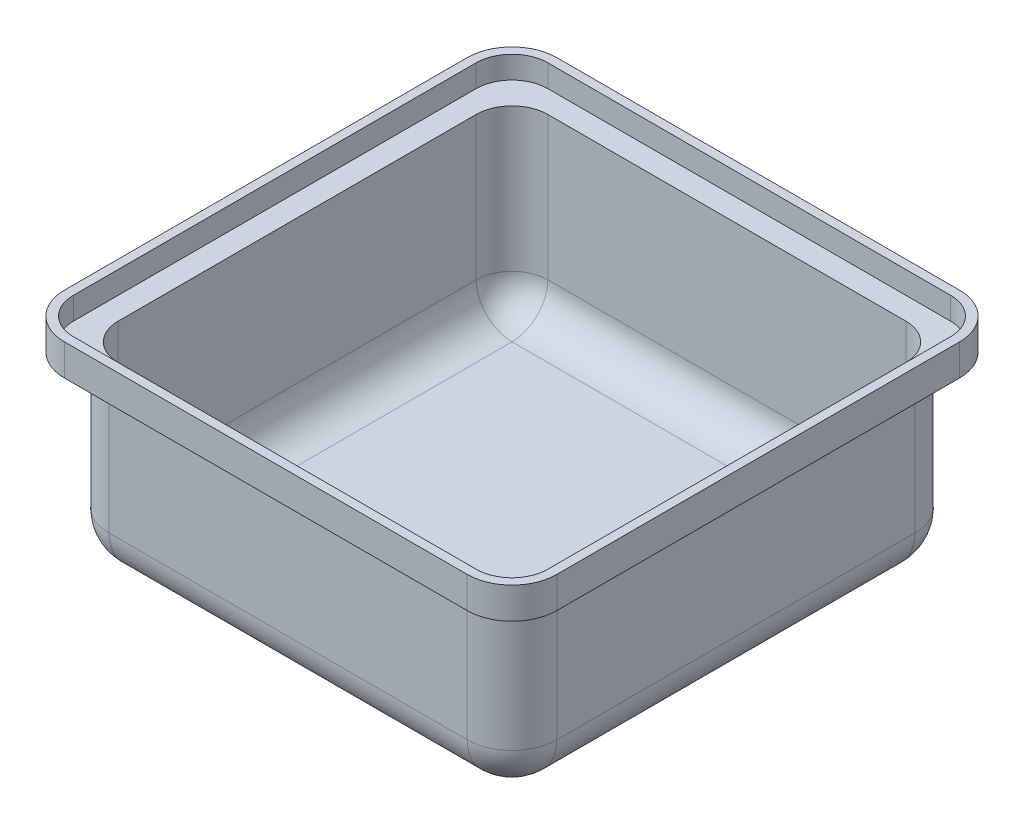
ISO-10303-21;
HEADER;
FILE_DESCRIPTION(('STEP AP214'),'2;1');
FILE_NAME('part.step','',(''),(''),'','','');
FILE_SCHEMA(('AUTOMOTIVE_DESIGN { 1 0 10303 214 1 1 1 1 }'));
ENDSEC;
DATA;
#1=APPLICATION_CONTEXT('core data for automotive mechanical design processes');
#2=APPLICATION_PROTOCOL_DEFINITION('international standard','automotive_design',2000,#1);
#3=PRODUCT_CONTEXT('',#1,'mechanical');
#4=PRODUCT('Part','Part','',(#3));
#5=PRODUCT_RELATED_PRODUCT_CATEGORY('part','',(#4));
#6=PRODUCT_DEFINITION_FORMATION('','',#4);
#7=PRODUCT_DEFINITION_CONTEXT('part definition',#1,'design');
#8=PRODUCT_DEFINITION('design','',#6,#7);
#9=PRODUCT_DEFINITION_SHAPE('','',#8);
#10=(LENGTH_UNIT() NAMED_UNIT(*) SI_UNIT(.MILLI.,.METRE.));
#11=(NAMED_UNIT(*) PLANE_ANGLE_UNIT() SI_UNIT($,.RADIAN.));
#12=(NAMED_UNIT(*) SI_UNIT($,.STERADIAN.) SOLID_ANGLE_UNIT());
#13=UNCERTAINTY_MEASURE_WITH_UNIT(LENGTH_MEASURE(1.E-05),#10,'distance_accuracy_value','');
#14=(GEOMETRIC_REPRESENTATION_CONTEXT(3) GLOBAL_UNCERTAINTY_ASSIGNED_CONTEXT((#13)) GLOBAL_UNIT_ASSIGNED_CONTEXT((#10,
#11,#12)) REPRESENTATION_CONTEXT('',''));
#15=CARTESIAN_POINT('',(0.,0.,0.));
#16=DIRECTION('',(0.,0.,1.));
#17=DIRECTION('',(1.,0.,0.));
#18=AXIS2_PLACEMENT_3D('',#15,#16,#17);
#19=CARTESIAN_POINT('',(69.85,59.69,69.85));
#20=DIRECTION('',(0.,-1.,0.));
#21=DIRECTION('',(0.,0.,-1.));
#22=AXIS2_PLACEMENT_3D('',#19,#20,#21);
#23=PLANE('',#22);
#24=DIRECTION('',(0.,0.,1.));
#25=VECTOR('',#24,1.);
#26=CARTESIAN_POINT('',(-69.85,59.69,-69.85));
#27=LINE('',#26,#25);
#28=CARTESIAN_POINT('',(-69.85,59.69,-57.15));
#29=VERTEX_POINT('',#28);
#30=CARTESIAN_POINT('',(-69.85,59.69,57.15));
#31=VERTEX_POINT('',#30);
#32=EDGE_CURVE('E439',#29,#31,#27,.T.);
#33=ORIENTED_EDGE('',*,*,#32,.T.);
#34=CARTESIAN_POINT('',(-57.15,59.69,57.15));
#35=DIRECTION('',(0.,-1.,0.));
#36=DIRECTION('',(0.,0.,-1.));
#37=AXIS2_PLACEMENT_3D('',#34,#35,#36);
#38=CIRCLE('',#37,12.7);
#39=CARTESIAN_POINT('',(-57.15,59.69,69.85));
#40=VERTEX_POINT('',#39);
#41=EDGE_CURVE('E515',#31,#40,#38,.F.);
#42=ORIENTED_EDGE('',*,*,#41,.T.);
#43=DIRECTION('',(1.,0.,0.));
#44=VECTOR('',#43,1.);
#45=CARTESIAN_POINT('',(69.85,59.69,69.85));
#46=LINE('',#45,#44);
#47=CARTESIAN_POINT('',(57.15,59.69,69.85));
#48=VERTEX_POINT('',#47);
#49=EDGE_CURVE('E442',#40,#48,#46,.T.);
#50=ORIENTED_EDGE('',*,*,#49,.T.);
#51=CARTESIAN_POINT('',(57.15,59.69,57.15));
#52=DIRECTION('',(0.,-1.,0.));
#53=DIRECTION('',(0.,0.,-1.));
#54=AXIS2_PLACEMENT_3D('',#51,#52,#53);
#55=CIRCLE('',#54,12.7);
#56=CARTESIAN_POINT('',(69.85,59.69,57.15));
#57=VERTEX_POINT('',#56);
#58=EDGE_CURVE('E509',#48,#57,#55,.F.);
#59=ORIENTED_EDGE('',*,*,#58,.T.);
#60=DIRECTION('',(0.,0.,-1.));
#61=VECTOR('',#60,1.);
#62=CARTESIAN_POINT('',(69.85,59.69,-69.85));
#63=LINE('',#62,#61);
#64=CARTESIAN_POINT('',(69.85,59.69,-57.15));
#65=VERTEX_POINT('',#64);
#66=EDGE_CURVE('E434',#57,#65,#63,.T.);
#67=ORIENTED_EDGE('',*,*,#66,.T.);
#68=CARTESIAN_POINT('',(57.15,59.69,-57.15));
#69=DIRECTION('',(0.,-1.,0.));
#70=DIRECTION('',(0.,0.,-1.));
#71=AXIS2_PLACEMENT_3D('',#68,#69,#70);
#72=CIRCLE('',#71,12.7);
#73=CARTESIAN_POINT('',(57.15,59.69,-69.85));
#74=VERTEX_POINT('',#73);
#75=EDGE_CURVE('E511',#65,#74,#72,.F.);
#76=ORIENTED_EDGE('',*,*,#75,.T.);
#77=DIRECTION('',(-1.,0.,0.));
#78=VECTOR('',#77,1.);
#79=CARTESIAN_POINT('',(69.85,59.69,-69.85));
#80=LINE('',#79,#78);
#81=CARTESIAN_POINT('',(-57.15,59.69,-69.85));
#82=VERTEX_POINT('',#81);
#83=EDGE_CURVE('E437',#74,#82,#80,.T.);
#84=ORIENTED_EDGE('',*,*,#83,.T.);
#85=CARTESIAN_POINT('',(-57.15,59.69,-57.15));
#86=DIRECTION('',(0.,-1.,0.));
#87=DIRECTION('',(0.,0.,-1.));
#88=AXIS2_PLACEMENT_3D('',#85,#86,#87);
#89=CIRCLE('',#88,12.7);
#90=EDGE_CURVE('E513',#82,#29,#89,.F.);
#91=ORIENTED_EDGE('',*,*,#90,.T.);
#92=EDGE_LOOP('',(#33,#42,#50,#59,#67,#76,#84,#91));
#93=FACE_BOUND('',#92,.T.);
#94=DIRECTION('',(0.,0.,1.));
#95=VECTOR('',#94,1.);
#96=CARTESIAN_POINT('',(-67.31,59.69,69.85));
#97=LINE('',#96,#95);
#98=CARTESIAN_POINT('',(-67.31,59.69,-57.15));
#99=VERTEX_POINT('',#98);
#100=CARTESIAN_POINT('',(-67.31,59.69,57.15));
#101=VERTEX_POINT('',#100);
#102=EDGE_CURVE('E379',#99,#101,#97,.T.);
#103=ORIENTED_EDGE('',*,*,#102,.F.);
#104=CARTESIAN_POINT('',(-57.15,59.69,-57.15));
#105=DIRECTION('',(0.,-1.,0.));
#106=DIRECTION('',(0.,0.,-1.));
#107=AXIS2_PLACEMENT_3D('',#104,#105,#106);
#108=CIRCLE('',#107,10.16);
#109=CARTESIAN_POINT('',(-57.15,59.69,-67.31));
#110=VERTEX_POINT('',#109);
#111=EDGE_CURVE('E377',#110,#99,#108,.F.);
#112=ORIENTED_EDGE('',*,*,#111,.F.);
#113=DIRECTION('',(-1.,0.,0.));
#114=VECTOR('',#113,1.);
#115=CARTESIAN_POINT('',(69.85,59.69,-67.31));
#116=LINE('',#115,#114);
#117=CARTESIAN_POINT('',(57.15,59.69,-67.31));
#118=VERTEX_POINT('',#117);
#119=EDGE_CURVE('E41',#118,#110,#116,.T.);
#120=ORIENTED_EDGE('',*,*,#119,.F.);
#121=CARTESIAN_POINT('',(57.15,59.69,-57.15));
#122=DIRECTION('',(0.,-1.,0.));
#123=DIRECTION('',(0.,0.,-1.));
#124=AXIS2_PLACEMENT_3D('',#121,#122,#123);
#125=CIRCLE('',#124,10.16);
#126=CARTESIAN_POINT('',(67.31,59.69,-57.15));
#127=VERTEX_POINT('',#126);
#128=EDGE_CURVE('E375',#127,#118,#125,.F.);
#129=ORIENTED_EDGE('',*,*,#128,.F.);
#130=DIRECTION('',(0.,0.,-1.));
#131=VECTOR('',#130,1.);
#132=CARTESIAN_POINT('',(67.31,59.69,69.85));
#133=LINE('',#132,#131);
#134=CARTESIAN_POINT('',(67.31,59.69,57.15));
#135=VERTEX_POINT('',#134);
#136=EDGE_CURVE('E371',#135,#127,#133,.T.);
#137=ORIENTED_EDGE('',*,*,#136,.F.);
#138=CARTESIAN_POINT('',(57.15,59.69,57.15));
#139=DIRECTION('',(0.,-1.,0.));
#140=DIRECTION('',(0.,0.,-1.));
#141=AXIS2_PLACEMENT_3D('',#138,#139,#140);
#142=CIRCLE('',#141,10.16);
#143=CARTESIAN_POINT('',(57.15,59.69,67.31));
#144=VERTEX_POINT('',#143);
#145=EDGE_CURVE('E365',#144,#135,#142,.F.);
#146=ORIENTED_EDGE('',*,*,#145,.F.);
#147=DIRECTION('',(1.,0.,0.));
#148=VECTOR('',#147,1.);
#149=CARTESIAN_POINT('',(69.85,59.69,67.31));
#150=LINE('',#149,#148);
#151=CARTESIAN_POINT('',(-57.15,59.69,67.31));
#152=VERTEX_POINT('',#151);
#153=EDGE_CURVE('E383',#152,#144,#150,.T.);
#154=ORIENTED_EDGE('',*,*,#153,.F.);
#155=CARTESIAN_POINT('',(-57.15,59.69,57.15));
#156=DIRECTION('',(0.,-1.,0.));
#157=DIRECTION('',(0.,0.,-1.));
#158=AXIS2_PLACEMENT_3D('',#155,#156,#157);
#159=CIRCLE('',#158,10.16);
#160=EDGE_CURVE('E357',#101,#152,#159,.F.);
#161=ORIENTED_EDGE('',*,*,#160,.F.);
#162=EDGE_LOOP('',(#103,#112,#120,#129,#137,#146,#154,#161));
#163=FACE_BOUND('',#162,.T.);
#164=ADVANCED_FACE('F26',(#93,#163),#23,.F.);
#165=CARTESIAN_POINT('',(-63.5,50.8,-63.5));
#166=DIRECTION('',(1.,0.,0.));
#167=DIRECTION('',(0.,0.,-1.));
#168=AXIS2_PLACEMENT_3D('',#165,#166,#167);
#169=PLANE('',#168);
#170=DIRECTION('',(0.,0.,1.));
#171=VECTOR('',#170,1.);
#172=CARTESIAN_POINT('',(-63.5,12.7,-63.5));
#173=LINE('',#172,#171);
#174=CARTESIAN_POINT('',(-63.5,12.7,-50.8));
#175=VERTEX_POINT('',#174);
#176=CARTESIAN_POINT('',(-63.5,12.7,50.8));
#177=VERTEX_POINT('',#176);
#178=EDGE_CURVE('E487',#175,#177,#173,.T.);
#179=ORIENTED_EDGE('',*,*,#178,.T.);
#180=DIRECTION('',(0.,-1.,0.));
#181=VECTOR('',#180,1.);
#182=CARTESIAN_POINT('',(-63.5,50.8,50.8));
#183=LINE('',#182,#181);
#184=CARTESIAN_POINT('',(-63.5,50.8,50.8));
#185=VERTEX_POINT('',#184);
#186=EDGE_CURVE('E489',#177,#185,#183,.F.);
#187=ORIENTED_EDGE('',*,*,#186,.T.);
#188=DIRECTION('',(0.,0.,1.));
#189=VECTOR('',#188,1.);
#190=CARTESIAN_POINT('',(-63.5,50.8,-63.5));
#191=LINE('',#190,#189);
#192=CARTESIAN_POINT('',(-63.5,50.8,-50.8));
#193=VERTEX_POINT('',#192);
#194=EDGE_CURVE('E445',#193,#185,#191,.T.);
#195=ORIENTED_EDGE('',*,*,#194,.F.);
#196=DIRECTION('',(0.,-1.,0.));
#197=VECTOR('',#196,1.);
#198=CARTESIAN_POINT('',(-63.5,50.8,-50.8));
#199=LINE('',#198,#197);
#200=EDGE_CURVE('E485',#193,#175,#199,.T.);
#201=ORIENTED_EDGE('',*,*,#200,.T.);
#202=EDGE_LOOP('',(#179,#187,#195,#201));
#203=FACE_BOUND('',#202,.T.);
#204=ADVANCED_FACE('F28',(#203),#169,.F.);
#205=CARTESIAN_POINT('',(-63.5,50.8,63.5));
#206=DIRECTION('',(0.,0.,-1.));
#207=DIRECTION('',(-1.,0.,0.));
#208=AXIS2_PLACEMENT_3D('',#205,#206,#207);
#209=PLANE('',#208);
#210=DIRECTION('',(1.,0.,0.));
#211=VECTOR('',#210,1.);
#212=CARTESIAN_POINT('',(-63.5,50.8,63.5));
#213=LINE('',#212,#211);
#214=CARTESIAN_POINT('',(-50.8,50.8,63.5));
#215=VERTEX_POINT('',#214);
#216=CARTESIAN_POINT('',(50.8,50.8,63.5));
#217=VERTEX_POINT('',#216);
#218=EDGE_CURVE('E448',#215,#217,#213,.T.);
#219=ORIENTED_EDGE('',*,*,#218,.F.);
#220=DIRECTION('',(0.,-1.,0.));
#221=VECTOR('',#220,1.);
#222=CARTESIAN_POINT('',(-50.8,50.8,63.5));
#223=LINE('',#222,#221);
#224=CARTESIAN_POINT('',(-50.8,12.7,63.5));
#225=VERTEX_POINT('',#224);
#226=EDGE_CURVE('E462',#215,#225,#223,.T.);
#227=ORIENTED_EDGE('',*,*,#226,.T.);
#228=DIRECTION('',(1.,0.,0.));
#229=VECTOR('',#228,1.);
#230=CARTESIAN_POINT('',(-63.5,12.7,63.5));
#231=LINE('',#230,#229);
#232=CARTESIAN_POINT('',(50.8,12.7,63.5));
#233=VERTEX_POINT('',#232);
#234=EDGE_CURVE('E459',#225,#233,#231,.T.);
#235=ORIENTED_EDGE('',*,*,#234,.T.);
#236=DIRECTION('',(0.,-1.,0.));
#237=VECTOR('',#236,1.);
#238=CARTESIAN_POINT('',(50.8,50.8,63.5));
#239=LINE('',#238,#237);
#240=EDGE_CURVE('E457',#233,#217,#239,.F.);
#241=ORIENTED_EDGE('',*,*,#240,.T.);
#242=EDGE_LOOP('',(#219,#227,#235,#241));
#243=FACE_BOUND('',#242,.T.);
#244=ADVANCED_FACE('F581',(#243),#209,.F.);
#245=CARTESIAN_POINT('',(63.5,50.8,-63.5));
#246=DIRECTION('',(-1.,0.,0.));
#247=DIRECTION('',(0.,0.,1.));
#248=AXIS2_PLACEMENT_3D('',#245,#246,#247);
#249=PLANE('',#248);
#250=DIRECTION('',(0.,0.,-1.));
#251=VECTOR('',#250,1.);
#252=CARTESIAN_POINT('',(63.5,50.8,-63.5));
#253=LINE('',#252,#251);
#254=CARTESIAN_POINT('',(63.5,50.8,50.8));
#255=VERTEX_POINT('',#254);
#256=CARTESIAN_POINT('',(63.5,50.8,-50.8));
#257=VERTEX_POINT('',#256);
#258=EDGE_CURVE('E451',#255,#257,#253,.T.);
#259=ORIENTED_EDGE('',*,*,#258,.F.);
#260=DIRECTION('',(0.,-1.,0.));
#261=VECTOR('',#260,1.);
#262=CARTESIAN_POINT('',(63.5,50.8,50.8));
#263=LINE('',#262,#261);
#264=CARTESIAN_POINT('',(63.5,12.7,50.8));
#265=VERTEX_POINT('',#264);
#266=EDGE_CURVE('E477',#255,#265,#263,.T.);
#267=ORIENTED_EDGE('',*,*,#266,.T.);
#268=DIRECTION('',(0.,0.,-1.));
#269=VECTOR('',#268,1.);
#270=CARTESIAN_POINT('',(63.5,12.7,-63.5));
#271=LINE('',#270,#269);
#272=CARTESIAN_POINT('',(63.5,12.7,-50.8));
#273=VERTEX_POINT('',#272);
#274=EDGE_CURVE('E475',#265,#273,#271,.T.);
#275=ORIENTED_EDGE('',*,*,#274,.T.);
#276=DIRECTION('',(0.,-1.,0.));
#277=VECTOR('',#276,1.);
#278=CARTESIAN_POINT('',(63.5,50.8,-50.8));
#279=LINE('',#278,#277);
#280=EDGE_CURVE('E473',#273,#257,#279,.F.);
#281=ORIENTED_EDGE('',*,*,#280,.T.);
#282=EDGE_LOOP('',(#259,#267,#275,#281));
#283=FACE_BOUND('',#282,.T.);
#284=ADVANCED_FACE('F590',(#283),#249,.F.);
#285=CARTESIAN_POINT('',(-63.5,50.8,-63.5));
#286=DIRECTION('',(0.,0.,1.));
#287=DIRECTION('',(1.,0.,0.));
#288=AXIS2_PLACEMENT_3D('',#285,#286,#287);
#289=PLANE('',#288);
#290=DIRECTION('',(-1.,0.,0.));
#291=VECTOR('',#290,1.);
#292=CARTESIAN_POINT('',(-63.5,50.8,-63.5));
#293=LINE('',#292,#291);
#294=CARTESIAN_POINT('',(50.8,50.8,-63.5));
#295=VERTEX_POINT('',#294);
#296=CARTESIAN_POINT('',(-50.8,50.8,-63.5));
#297=VERTEX_POINT('',#296);
#298=EDGE_CURVE('E454',#295,#297,#293,.T.);
#299=ORIENTED_EDGE('',*,*,#298,.F.);
#300=DIRECTION('',(0.,-1.,0.));
#301=VECTOR('',#300,1.);
#302=CARTESIAN_POINT('',(50.8,50.8,-63.5));
#303=LINE('',#302,#301);
#304=CARTESIAN_POINT('',(50.8,12.7,-63.5));
#305=VERTEX_POINT('',#304);
#306=EDGE_CURVE('E483',#295,#305,#303,.T.);
#307=ORIENTED_EDGE('',*,*,#306,.T.);
#308=DIRECTION('',(-1.,0.,0.));
#309=VECTOR('',#308,1.);
#310=CARTESIAN_POINT('',(-63.5,12.7,-63.5));
#311=LINE('',#310,#309);
#312=CARTESIAN_POINT('',(-50.8,12.7,-63.5));
#313=VERTEX_POINT('',#312);
#314=EDGE_CURVE('E481',#305,#313,#311,.T.);
#315=ORIENTED_EDGE('',*,*,#314,.T.);
#316=DIRECTION('',(0.,-1.,0.));
#317=VECTOR('',#316,1.);
#318=CARTESIAN_POINT('',(-50.8,50.8,-63.5));
#319=LINE('',#318,#317);
#320=EDGE_CURVE('E479',#313,#297,#319,.F.);
#321=ORIENTED_EDGE('',*,*,#320,.T.);
#322=EDGE_LOOP('',(#299,#307,#315,#321));
#323=FACE_BOUND('',#322,.T.);
#324=ADVANCED_FACE('F539',(#323),#289,.F.);
#325=CARTESIAN_POINT('',(-63.5,0.,63.5));
#326=DIRECTION('',(0.,1.,0.));
#327=DIRECTION('',(0.,0.,1.));
#328=AXIS2_PLACEMENT_3D('',#325,#326,#327);
#329=PLANE('',#328);
#330=DIRECTION('',(0.,0.,-1.));
#331=VECTOR('',#330,1.);
#332=CARTESIAN_POINT('',(50.8,0.,63.5));
#333=LINE('',#332,#331);
#334=CARTESIAN_POINT('',(50.8,0.,-50.8));
#335=VERTEX_POINT('',#334);
#336=CARTESIAN_POINT('',(50.8,0.,50.8));
#337=VERTEX_POINT('',#336);
#338=EDGE_CURVE('E468',#335,#337,#333,.F.);
#339=ORIENTED_EDGE('',*,*,#338,.T.);
#340=DIRECTION('',(1.,0.,0.));
#341=VECTOR('',#340,1.);
#342=CARTESIAN_POINT('',(-63.5,0.,50.8));
#343=LINE('',#342,#341);
#344=CARTESIAN_POINT('',(-50.8,0.,50.8));
#345=VERTEX_POINT('',#344);
#346=EDGE_CURVE('E470',#337,#345,#343,.F.);
#347=ORIENTED_EDGE('',*,*,#346,.T.);
#348=DIRECTION('',(0.,0.,1.));
#349=VECTOR('',#348,1.);
#350=CARTESIAN_POINT('',(-50.8,0.,63.5));
#351=LINE('',#350,#349);
#352=CARTESIAN_POINT('',(-50.8,0.,-50.8));
#353=VERTEX_POINT('',#352);
#354=EDGE_CURVE('E464',#345,#353,#351,.F.);
#355=ORIENTED_EDGE('',*,*,#354,.T.);
#356=DIRECTION('',(-1.,0.,0.));
#357=VECTOR('',#356,1.);
#358=CARTESIAN_POINT('',(-63.5,0.,-50.8));
#359=LINE('',#358,#357);
#360=EDGE_CURVE('E466',#353,#335,#359,.F.);
#361=ORIENTED_EDGE('',*,*,#360,.T.);
#362=EDGE_LOOP('',(#339,#347,#355,#361));
#363=FACE_BOUND('',#362,.T.);
#364=ADVANCED_FACE('F595',(#363),#329,.F.);
#365=CARTESIAN_POINT('',(69.85,50.8,69.85));
#366=DIRECTION('',(0.,-1.,0.));
#367=DIRECTION('',(0.,0.,-1.));
#368=AXIS2_PLACEMENT_3D('',#365,#366,#367);
#369=PLANE('',#368);
#370=DIRECTION('',(1.,0.,0.));
#371=VECTOR('',#370,1.);
#372=CARTESIAN_POINT('',(69.85,50.8,69.85));
#373=LINE('',#372,#371);
#374=CARTESIAN_POINT('',(-57.15,50.8,69.85));
#375=VERTEX_POINT('',#374);
#376=CARTESIAN_POINT('',(57.15,50.8,69.85));
#377=VERTEX_POINT('',#376);
#378=EDGE_CURVE('E431',#375,#377,#373,.T.);
#379=ORIENTED_EDGE('',*,*,#378,.F.);
#380=CARTESIAN_POINT('',(-57.15,50.8,57.15));
#381=DIRECTION('',(0.,-1.,0.));
#382=DIRECTION('',(0.,0.,-1.));
#383=AXIS2_PLACEMENT_3D('',#380,#381,#382);
#384=CIRCLE('',#383,12.7);
#385=CARTESIAN_POINT('',(-69.85,50.8,57.15));
#386=VERTEX_POINT('',#385);
#387=EDGE_CURVE('E502',#375,#386,#384,.T.);
#388=ORIENTED_EDGE('',*,*,#387,.T.);
#389=DIRECTION('',(0.,0.,1.));
#390=VECTOR('',#389,1.);
#391=CARTESIAN_POINT('',(-69.85,50.8,-69.85));
#392=LINE('',#391,#390);
#393=CARTESIAN_POINT('',(-69.85,50.8,-57.15));
#394=VERTEX_POINT('',#393);
#395=EDGE_CURVE('E428',#394,#386,#392,.T.);
#396=ORIENTED_EDGE('',*,*,#395,.F.);
#397=CARTESIAN_POINT('',(-57.15,50.8,-57.15));
#398=DIRECTION('',(0.,-1.,0.));
#399=DIRECTION('',(0.,0.,-1.));
#400=AXIS2_PLACEMENT_3D('',#397,#398,#399);
#401=CIRCLE('',#400,12.7);
#402=CARTESIAN_POINT('',(-57.15,50.8,-69.85));
#403=VERTEX_POINT('',#402);
#404=EDGE_CURVE('E500',#394,#403,#401,.T.);
#405=ORIENTED_EDGE('',*,*,#404,.T.);
#406=DIRECTION('',(-1.,0.,0.));
#407=VECTOR('',#406,1.);
#408=CARTESIAN_POINT('',(69.85,50.8,-69.85));
#409=LINE('',#408,#407);
#410=CARTESIAN_POINT('',(57.15,50.8,-69.85));
#411=VERTEX_POINT('',#410);
#412=EDGE_CURVE('E426',#411,#403,#409,.T.);
#413=ORIENTED_EDGE('',*,*,#412,.F.);
#414=CARTESIAN_POINT('',(57.15,50.8,-57.15));
#415=DIRECTION('',(0.,-1.,0.));
#416=DIRECTION('',(0.,0.,-1.));
#417=AXIS2_PLACEMENT_3D('',#414,#415,#416);
#418=CIRCLE('',#417,12.7);
#419=CARTESIAN_POINT('',(69.85,50.8,-57.15));
#420=VERTEX_POINT('',#419);
#421=EDGE_CURVE('E498',#411,#420,#418,.T.);
#422=ORIENTED_EDGE('',*,*,#421,.T.);
#423=DIRECTION('',(0.,0.,-1.));
#424=VECTOR('',#423,1.);
#425=CARTESIAN_POINT('',(69.85,50.8,-69.85));
#426=LINE('',#425,#424);
#427=CARTESIAN_POINT('',(69.85,50.8,57.15));
#428=VERTEX_POINT('',#427);
#429=EDGE_CURVE('E423',#428,#420,#426,.T.);
#430=ORIENTED_EDGE('',*,*,#429,.F.);
#431=CARTESIAN_POINT('',(57.15,50.8,57.15));
#432=DIRECTION('',(0.,-1.,0.));
#433=DIRECTION('',(0.,0.,-1.));
#434=AXIS2_PLACEMENT_3D('',#431,#432,#433);
#435=CIRCLE('',#434,12.7);
#436=EDGE_CURVE('E496',#428,#377,#435,.T.);
#437=ORIENTED_EDGE('',*,*,#436,.T.);
#438=EDGE_LOOP('',(#379,#388,#396,#405,#413,#422,#430,#437));
#439=FACE_BOUND('',#438,.T.);
#440=ORIENTED_EDGE('',*,*,#298,.T.);
#441=CARTESIAN_POINT('',(-50.8,50.8,-50.8));
#442=DIRECTION('',(0.,-1.,0.));
#443=DIRECTION('',(0.,0.,-1.));
#444=AXIS2_PLACEMENT_3D('',#441,#442,#443);
#445=CIRCLE('',#444,12.7);
#446=EDGE_CURVE('E11',#297,#193,#445,.F.);
#447=ORIENTED_EDGE('',*,*,#446,.T.);
#448=ORIENTED_EDGE('',*,*,#194,.T.);
#449=CARTESIAN_POINT('',(-50.8,50.8,50.8));
#450=DIRECTION('',(0.,-1.,0.));
#451=DIRECTION('',(0.,0.,-1.));
#452=AXIS2_PLACEMENT_3D('',#449,#450,#451);
#453=CIRCLE('',#452,12.7);
#454=EDGE_CURVE('E526',#185,#215,#453,.F.);
#455=ORIENTED_EDGE('',*,*,#454,.T.);
#456=ORIENTED_EDGE('',*,*,#218,.T.);
#457=CARTESIAN_POINT('',(50.8,50.8,50.8));
#458=DIRECTION('',(0.,-1.,0.));
#459=DIRECTION('',(0.,0.,-1.));
#460=AXIS2_PLACEMENT_3D('',#457,#458,#459);
#461=CIRCLE('',#460,12.7);
#462=EDGE_CURVE('E528',#217,#255,#461,.F.);
#463=ORIENTED_EDGE('',*,*,#462,.T.);
#464=ORIENTED_EDGE('',*,*,#258,.T.);
#465=CARTESIAN_POINT('',(50.8,50.8,-50.8));
#466=DIRECTION('',(0.,-1.,0.));
#467=DIRECTION('',(0.,0.,-1.));
#468=AXIS2_PLACEMENT_3D('',#465,#466,#467);
#469=CIRCLE('',#468,12.7);
#470=EDGE_CURVE('E34',#257,#295,#469,.F.);
#471=ORIENTED_EDGE('',*,*,#470,.T.);
#472=EDGE_LOOP('',(#440,#447,#448,#455,#456,#463,#464,#471));
#473=FACE_BOUND('',#472,.T.);
#474=ADVANCED_FACE('F532',(#439,#473),#369,.T.);
#475=CARTESIAN_POINT('',(69.85,59.69,-69.85));
#476=DIRECTION('',(-1.,0.,0.));
#477=DIRECTION('',(0.,0.,1.));
#478=AXIS2_PLACEMENT_3D('',#475,#476,#477);
#479=PLANE('',#478);
#480=ORIENTED_EDGE('',*,*,#429,.T.);
#481=DIRECTION('',(0.,-1.,0.));
#482=VECTOR('',#481,1.);
#483=CARTESIAN_POINT('',(69.85,59.69,-57.15));
#484=LINE('',#483,#482);
#485=EDGE_CURVE('E524',#420,#65,#484,.F.);
#486=ORIENTED_EDGE('',*,*,#485,.T.);
#487=ORIENTED_EDGE('',*,*,#66,.F.);
#488=DIRECTION('',(0.,-1.,0.));
#489=VECTOR('',#488,1.);
#490=CARTESIAN_POINT('',(69.85,59.69,57.15));
#491=LINE('',#490,#489);
#492=EDGE_CURVE('E521',#57,#428,#491,.T.);
#493=ORIENTED_EDGE('',*,*,#492,.T.);
#494=EDGE_LOOP('',(#480,#486,#487,#493));
#495=FACE_BOUND('',#494,.T.);
#496=ADVANCED_FACE('F630',(#495),#479,.F.);
#497=CARTESIAN_POINT('',(69.85,59.69,-69.85));
#498=DIRECTION('',(0.,0.,1.));
#499=DIRECTION('',(1.,0.,0.));
#500=AXIS2_PLACEMENT_3D('',#497,#498,#499);
#501=PLANE('',#500);
#502=ORIENTED_EDGE('',*,*,#412,.T.);
#503=DIRECTION('',(0.,-1.,0.));
#504=VECTOR('',#503,1.);
#505=CARTESIAN_POINT('',(-57.15,59.69,-69.85));
#506=LINE('',#505,#504);
#507=EDGE_CURVE('E49',#403,#82,#506,.F.);
#508=ORIENTED_EDGE('',*,*,#507,.T.);
#509=ORIENTED_EDGE('',*,*,#83,.F.);
#510=DIRECTION('',(0.,-1.,0.));
#511=VECTOR('',#510,1.);
#512=CARTESIAN_POINT('',(57.15,59.69,-69.85));
#513=LINE('',#512,#511);
#514=EDGE_CURVE('E517',#74,#411,#513,.T.);
#515=ORIENTED_EDGE('',*,*,#514,.T.);
#516=EDGE_LOOP('',(#502,#508,#509,#515));
#517=FACE_BOUND('',#516,.T.);
#518=ADVANCED_FACE('F626',(#517),#501,.F.);
#519=CARTESIAN_POINT('',(-69.85,59.69,-69.85));
#520=DIRECTION('',(1.,0.,0.));
#521=DIRECTION('',(0.,0.,-1.));
#522=AXIS2_PLACEMENT_3D('',#519,#520,#521);
#523=PLANE('',#522);
#524=ORIENTED_EDGE('',*,*,#395,.T.);
#525=DIRECTION('',(0.,-1.,0.));
#526=VECTOR('',#525,1.);
#527=CARTESIAN_POINT('',(-69.85,59.69,57.15));
#528=LINE('',#527,#526);
#529=EDGE_CURVE('E507',#386,#31,#528,.F.);
#530=ORIENTED_EDGE('',*,*,#529,.T.);
#531=ORIENTED_EDGE('',*,*,#32,.F.);
#532=DIRECTION('',(0.,-1.,0.));
#533=VECTOR('',#532,1.);
#534=CARTESIAN_POINT('',(-69.85,59.69,-57.15));
#535=LINE('',#534,#533);
#536=EDGE_CURVE('E504',#29,#394,#535,.T.);
#537=ORIENTED_EDGE('',*,*,#536,.T.);
#538=EDGE_LOOP('',(#524,#530,#531,#537));
#539=FACE_BOUND('',#538,.T.);
#540=ADVANCED_FACE('F622',(#539),#523,.F.);
#541=CARTESIAN_POINT('',(69.85,59.69,69.85));
#542=DIRECTION('',(0.,0.,-1.));
#543=DIRECTION('',(-1.,0.,0.));
#544=AXIS2_PLACEMENT_3D('',#541,#542,#543);
#545=PLANE('',#544);
#546=ORIENTED_EDGE('',*,*,#49,.F.);
#547=DIRECTION('',(0.,-1.,0.));
#548=VECTOR('',#547,1.);
#549=CARTESIAN_POINT('',(-57.15,59.69,69.85));
#550=LINE('',#549,#548);
#551=EDGE_CURVE('E493',#40,#375,#550,.T.);
#552=ORIENTED_EDGE('',*,*,#551,.T.);
#553=ORIENTED_EDGE('',*,*,#378,.T.);
#554=DIRECTION('',(0.,-1.,0.));
#555=VECTOR('',#554,1.);
#556=CARTESIAN_POINT('',(57.15,59.69,69.85));
#557=LINE('',#556,#555);
#558=EDGE_CURVE('E491',#377,#48,#557,.F.);
#559=ORIENTED_EDGE('',*,*,#558,.T.);
#560=EDGE_LOOP('',(#546,#552,#553,#559));
#561=FACE_BOUND('',#560,.T.);
#562=ADVANCED_FACE('F619',(#561),#545,.F.);
#563=CARTESIAN_POINT('',(-50.8,50.8,-50.8));
#564=DIRECTION('',(0.,-1.,0.));
#565=DIRECTION('',(0.,0.,-1.));
#566=AXIS2_PLACEMENT_3D('',#563,#564,#565);
#567=CYLINDRICAL_SURFACE('',#566,12.7);
#568=ORIENTED_EDGE('',*,*,#446,.F.);
#569=ORIENTED_EDGE('',*,*,#320,.F.);
#570=CARTESIAN_POINT('',(-50.8,12.7,-50.8));
#571=DIRECTION('',(0.,-1.,0.));
#572=DIRECTION('',(0.,0.,-1.));
#573=AXIS2_PLACEMENT_3D('',#570,#571,#572);
#574=CIRCLE('',#573,12.7);
#575=EDGE_CURVE('E417',#175,#313,#574,.T.);
#576=ORIENTED_EDGE('',*,*,#575,.F.);
#577=ORIENTED_EDGE('',*,*,#200,.F.);
#578=EDGE_LOOP('',(#568,#569,#576,#577));
#579=FACE_BOUND('',#578,.T.);
#580=ADVANCED_FACE('F555',(#579),#567,.T.);
#581=CARTESIAN_POINT('',(50.8,50.8,-50.8));
#582=DIRECTION('',(0.,-1.,0.));
#583=DIRECTION('',(0.,0.,-1.));
#584=AXIS2_PLACEMENT_3D('',#581,#582,#583);
#585=CYLINDRICAL_SURFACE('',#584,12.7);
#586=ORIENTED_EDGE('',*,*,#470,.F.);
#587=ORIENTED_EDGE('',*,*,#280,.F.);
#588=CARTESIAN_POINT('',(50.8,12.7,-50.8));
#589=DIRECTION('',(0.,-1.,0.));
#590=DIRECTION('',(0.,0.,-1.));
#591=AXIS2_PLACEMENT_3D('',#588,#589,#590);
#592=CIRCLE('',#591,12.7);
#593=EDGE_CURVE('E414',#305,#273,#592,.T.);
#594=ORIENTED_EDGE('',*,*,#593,.F.);
#595=ORIENTED_EDGE('',*,*,#306,.F.);
#596=EDGE_LOOP('',(#586,#587,#594,#595));
#597=FACE_BOUND('',#596,.T.);
#598=ADVANCED_FACE('F543',(#597),#585,.T.);
#599=CARTESIAN_POINT('',(-63.5,12.7,-50.8));
#600=DIRECTION('',(-1.,0.,0.));
#601=DIRECTION('',(0.,0.,1.));
#602=AXIS2_PLACEMENT_3D('',#599,#600,#601);
#603=CYLINDRICAL_SURFACE('',#602,12.7);
#604=CARTESIAN_POINT('',(-50.8,12.7,-50.8));
#605=DIRECTION('',(-1.,0.,0.));
#606=DIRECTION('',(0.,0.,1.));
#607=AXIS2_PLACEMENT_3D('',#604,#605,#606);
#608=CIRCLE('',#607,12.7);
#609=EDGE_CURVE('E420',#313,#353,#608,.T.);
#610=ORIENTED_EDGE('',*,*,#609,.F.);
#611=ORIENTED_EDGE('',*,*,#314,.F.);
#612=CARTESIAN_POINT('',(50.8,12.7,-50.8));
#613=DIRECTION('',(1.,0.,0.));
#614=DIRECTION('',(0.,0.,-1.));
#615=AXIS2_PLACEMENT_3D('',#612,#613,#614);
#616=CIRCLE('',#615,12.7);
#617=EDGE_CURVE('E411',#335,#305,#616,.T.);
#618=ORIENTED_EDGE('',*,*,#617,.F.);
#619=ORIENTED_EDGE('',*,*,#360,.F.);
#620=EDGE_LOOP('',(#610,#611,#618,#619));
#621=FACE_BOUND('',#620,.T.);
#622=ADVANCED_FACE('F552',(#621),#603,.T.);
#623=CARTESIAN_POINT('',(-50.8,12.7,-50.8));
#624=DIRECTION('',(0.,0.,1.));
#625=DIRECTION('',(1.,0.,0.));
#626=AXIS2_PLACEMENT_3D('',#623,#624,#625);
#627=SPHERICAL_SURFACE('',#626,12.7);
#628=ORIENTED_EDGE('',*,*,#575,.T.);
#629=ORIENTED_EDGE('',*,*,#609,.T.);
#630=CARTESIAN_POINT('',(-50.8,12.7,-50.8));
#631=DIRECTION('',(0.,0.,-1.));
#632=DIRECTION('',(-1.,0.,0.));
#633=AXIS2_PLACEMENT_3D('',#630,#631,#632);
#634=CIRCLE('',#633,12.7);
#635=EDGE_CURVE('E408',#175,#353,#634,.F.);
#636=ORIENTED_EDGE('',*,*,#635,.F.);
#637=EDGE_LOOP('',(#628,#629,#636));
#638=FACE_BOUND('',#637,.T.);
#639=ADVANCED_FACE('F695',(#638),#627,.T.);
#640=CARTESIAN_POINT('',(50.8,12.7,-50.8));
#641=DIRECTION('',(0.,0.,1.));
#642=DIRECTION('',(1.,0.,0.));
#643=AXIS2_PLACEMENT_3D('',#640,#641,#642);
#644=SPHERICAL_SURFACE('',#643,12.7);
#645=ORIENTED_EDGE('',*,*,#617,.T.);
#646=ORIENTED_EDGE('',*,*,#593,.T.);
#647=CARTESIAN_POINT('',(50.8,12.7,-50.8));
#648=DIRECTION('',(0.,0.,-1.));
#649=DIRECTION('',(-1.,0.,0.));
#650=AXIS2_PLACEMENT_3D('',#647,#648,#649);
#651=CIRCLE('',#650,12.7);
#652=EDGE_CURVE('E405',#335,#273,#651,.F.);
#653=ORIENTED_EDGE('',*,*,#652,.F.);
#654=EDGE_LOOP('',(#645,#646,#653));
#655=FACE_BOUND('',#654,.T.);
#656=ADVANCED_FACE('F547',(#655),#644,.T.);
#657=CARTESIAN_POINT('',(-50.8,12.7,-63.5));
#658=DIRECTION('',(0.,0.,1.));
#659=DIRECTION('',(1.,0.,0.));
#660=AXIS2_PLACEMENT_3D('',#657,#658,#659);
#661=CYLINDRICAL_SURFACE('',#660,12.7);
#662=ORIENTED_EDGE('',*,*,#635,.T.);
#663=ORIENTED_EDGE('',*,*,#354,.F.);
#664=CARTESIAN_POINT('',(-50.8,12.7,50.8));
#665=DIRECTION('',(0.,0.,1.));
#666=DIRECTION('',(1.,0.,0.));
#667=AXIS2_PLACEMENT_3D('',#664,#665,#666);
#668=CIRCLE('',#667,12.7);
#669=EDGE_CURVE('E402',#177,#345,#668,.T.);
#670=ORIENTED_EDGE('',*,*,#669,.F.);
#671=ORIENTED_EDGE('',*,*,#178,.F.);
#672=EDGE_LOOP('',(#662,#663,#670,#671));
#673=FACE_BOUND('',#672,.T.);
#674=ADVANCED_FACE('F571',(#673),#661,.T.);
#675=CARTESIAN_POINT('',(-50.8,50.8,50.8));
#676=DIRECTION('',(0.,-1.,0.));
#677=DIRECTION('',(0.,0.,-1.));
#678=AXIS2_PLACEMENT_3D('',#675,#676,#677);
#679=CYLINDRICAL_SURFACE('',#678,12.7);
#680=ORIENTED_EDGE('',*,*,#454,.F.);
#681=ORIENTED_EDGE('',*,*,#186,.F.);
#682=CARTESIAN_POINT('',(-50.8,12.7,50.8));
#683=DIRECTION('',(0.,-1.,0.));
#684=DIRECTION('',(0.,0.,-1.));
#685=AXIS2_PLACEMENT_3D('',#682,#683,#684);
#686=CIRCLE('',#685,12.7);
#687=EDGE_CURVE('E399',#225,#177,#686,.T.);
#688=ORIENTED_EDGE('',*,*,#687,.F.);
#689=ORIENTED_EDGE('',*,*,#226,.F.);
#690=EDGE_LOOP('',(#680,#681,#688,#689));
#691=FACE_BOUND('',#690,.T.);
#692=ADVANCED_FACE('F566',(#691),#679,.T.);
#693=CARTESIAN_POINT('',(50.8,50.8,50.8));
#694=DIRECTION('',(0.,-1.,0.));
#695=DIRECTION('',(0.,0.,-1.));
#696=AXIS2_PLACEMENT_3D('',#693,#694,#695);
#697=CYLINDRICAL_SURFACE('',#696,12.7);
#698=ORIENTED_EDGE('',*,*,#462,.F.);
#699=ORIENTED_EDGE('',*,*,#240,.F.);
#700=CARTESIAN_POINT('',(50.8,12.7,50.8));
#701=DIRECTION('',(0.,-1.,0.));
#702=DIRECTION('',(0.,0.,-1.));
#703=AXIS2_PLACEMENT_3D('',#700,#701,#702);
#704=CIRCLE('',#703,12.7);
#705=EDGE_CURVE('E396',#265,#233,#704,.T.);
#706=ORIENTED_EDGE('',*,*,#705,.F.);
#707=ORIENTED_EDGE('',*,*,#266,.F.);
#708=EDGE_LOOP('',(#698,#699,#706,#707));
#709=FACE_BOUND('',#708,.T.);
#710=ADVANCED_FACE('F586',(#709),#697,.T.);
#711=CARTESIAN_POINT('',(50.8,12.7,-63.5));
#712=DIRECTION('',(0.,0.,-1.));
#713=DIRECTION('',(-1.,0.,0.));
#714=AXIS2_PLACEMENT_3D('',#711,#712,#713);
#715=CYLINDRICAL_SURFACE('',#714,12.7);
#716=ORIENTED_EDGE('',*,*,#652,.T.);
#717=ORIENTED_EDGE('',*,*,#274,.F.);
#718=CARTESIAN_POINT('',(50.8,12.7,50.8));
#719=DIRECTION('',(0.,0.,1.));
#720=DIRECTION('',(1.,0.,0.));
#721=AXIS2_PLACEMENT_3D('',#718,#719,#720);
#722=CIRCLE('',#721,12.7);
#723=EDGE_CURVE('E393',#337,#265,#722,.T.);
#724=ORIENTED_EDGE('',*,*,#723,.F.);
#725=ORIENTED_EDGE('',*,*,#338,.F.);
#726=EDGE_LOOP('',(#716,#717,#724,#725));
#727=FACE_BOUND('',#726,.T.);
#728=ADVANCED_FACE('F593',(#727),#715,.T.);
#729=CARTESIAN_POINT('',(-50.8,12.7,50.8));
#730=DIRECTION('',(0.,0.,1.));
#731=DIRECTION('',(1.,0.,0.));
#732=AXIS2_PLACEMENT_3D('',#729,#730,#731);
#733=SPHERICAL_SURFACE('',#732,12.7);
#734=ORIENTED_EDGE('',*,*,#687,.T.);
#735=ORIENTED_EDGE('',*,*,#669,.T.);
#736=CARTESIAN_POINT('',(-50.8,12.7,50.8));
#737=DIRECTION('',(-1.,0.,0.));
#738=DIRECTION('',(0.,0.,1.));
#739=AXIS2_PLACEMENT_3D('',#736,#737,#738);
#740=CIRCLE('',#739,12.7);
#741=EDGE_CURVE('E390',#225,#345,#740,.F.);
#742=ORIENTED_EDGE('',*,*,#741,.F.);
#743=EDGE_LOOP('',(#734,#735,#742));
#744=FACE_BOUND('',#743,.T.);
#745=ADVANCED_FACE('F573',(#744),#733,.T.);
#746=CARTESIAN_POINT('',(50.8,12.7,50.8));
#747=DIRECTION('',(0.,0.,1.));
#748=DIRECTION('',(1.,0.,0.));
#749=AXIS2_PLACEMENT_3D('',#746,#747,#748);
#750=SPHERICAL_SURFACE('',#749,12.7);
#751=ORIENTED_EDGE('',*,*,#723,.T.);
#752=ORIENTED_EDGE('',*,*,#705,.T.);
#753=CARTESIAN_POINT('',(50.8,12.7,50.8));
#754=DIRECTION('',(1.,0.,0.));
#755=DIRECTION('',(0.,0.,-1.));
#756=AXIS2_PLACEMENT_3D('',#753,#754,#755);
#757=CIRCLE('',#756,12.7);
#758=EDGE_CURVE('E388',#337,#233,#757,.F.);
#759=ORIENTED_EDGE('',*,*,#758,.F.);
#760=EDGE_LOOP('',(#751,#752,#759));
#761=FACE_BOUND('',#760,.T.);
#762=ADVANCED_FACE('F597',(#761),#750,.T.);
#763=CARTESIAN_POINT('',(-63.5,12.7,50.8));
#764=DIRECTION('',(1.,0.,0.));
#765=DIRECTION('',(0.,0.,-1.));
#766=AXIS2_PLACEMENT_3D('',#763,#764,#765);
#767=CYLINDRICAL_SURFACE('',#766,12.7);
#768=ORIENTED_EDGE('',*,*,#741,.T.);
#769=ORIENTED_EDGE('',*,*,#346,.F.);
#770=ORIENTED_EDGE('',*,*,#758,.T.);
#771=ORIENTED_EDGE('',*,*,#234,.F.);
#772=EDGE_LOOP('',(#768,#769,#770,#771));
#773=FACE_BOUND('',#772,.T.);
#774=ADVANCED_FACE('F577',(#773),#767,.T.);
#775=CARTESIAN_POINT('',(-57.15,59.69,57.15));
#776=DIRECTION('',(0.,-1.,0.));
#777=DIRECTION('',(0.,0.,-1.));
#778=AXIS2_PLACEMENT_3D('',#775,#776,#777);
#779=CYLINDRICAL_SURFACE('',#778,12.7);
#780=ORIENTED_EDGE('',*,*,#41,.F.);
#781=ORIENTED_EDGE('',*,*,#529,.F.);
#782=ORIENTED_EDGE('',*,*,#387,.F.);
#783=ORIENTED_EDGE('',*,*,#551,.F.);
#784=EDGE_LOOP('',(#780,#781,#782,#783));
#785=FACE_BOUND('',#784,.T.);
#786=ADVANCED_FACE('F604',(#785),#779,.T.);
#787=CARTESIAN_POINT('',(-57.15,59.69,-57.15));
#788=DIRECTION('',(0.,-1.,0.));
#789=DIRECTION('',(0.,0.,-1.));
#790=AXIS2_PLACEMENT_3D('',#787,#788,#789);
#791=CYLINDRICAL_SURFACE('',#790,12.7);
#792=ORIENTED_EDGE('',*,*,#90,.F.);
#793=ORIENTED_EDGE('',*,*,#507,.F.);
#794=ORIENTED_EDGE('',*,*,#404,.F.);
#795=ORIENTED_EDGE('',*,*,#536,.F.);
#796=EDGE_LOOP('',(#792,#793,#794,#795));
#797=FACE_BOUND('',#796,.T.);
#798=ADVANCED_FACE('F750',(#797),#791,.T.);
#799=CARTESIAN_POINT('',(57.15,59.69,-57.15));
#800=DIRECTION('',(0.,-1.,0.));
#801=DIRECTION('',(0.,0.,-1.));
#802=AXIS2_PLACEMENT_3D('',#799,#800,#801);
#803=CYLINDRICAL_SURFACE('',#802,12.7);
#804=ORIENTED_EDGE('',*,*,#75,.F.);
#805=ORIENTED_EDGE('',*,*,#485,.F.);
#806=ORIENTED_EDGE('',*,*,#421,.F.);
#807=ORIENTED_EDGE('',*,*,#514,.F.);
#808=EDGE_LOOP('',(#804,#805,#806,#807));
#809=FACE_BOUND('',#808,.T.);
#810=ADVANCED_FACE('F758',(#809),#803,.T.);
#811=CARTESIAN_POINT('',(57.15,59.69,57.15));
#812=DIRECTION('',(0.,-1.,0.));
#813=DIRECTION('',(0.,0.,-1.));
#814=AXIS2_PLACEMENT_3D('',#811,#812,#813);
#815=CYLINDRICAL_SURFACE('',#814,12.7);
#816=ORIENTED_EDGE('',*,*,#58,.F.);
#817=ORIENTED_EDGE('',*,*,#558,.F.);
#818=ORIENTED_EDGE('',*,*,#436,.F.);
#819=ORIENTED_EDGE('',*,*,#492,.F.);
#820=EDGE_LOOP('',(#816,#817,#818,#819));
#821=FACE_BOUND('',#820,.T.);
#822=ADVANCED_FACE('F766',(#821),#815,.T.);
#823=CARTESIAN_POINT('',(-60.96,50.8,-63.5));
#824=DIRECTION('',(1.,0.,0.));
#825=DIRECTION('',(0.,0.,-1.));
#826=AXIS2_PLACEMENT_3D('',#823,#824,#825);
#827=PLANE('',#826);
#828=DIRECTION('',(0.,0.,-1.));
#829=VECTOR('',#828,1.);
#830=CARTESIAN_POINT('',(-60.96,12.7,-63.5));
#831=LINE('',#830,#829);
#832=CARTESIAN_POINT('',(-60.96,12.7,-50.8));
#833=VERTEX_POINT('',#832);
#834=CARTESIAN_POINT('',(-60.96,12.7,50.8));
#835=VERTEX_POINT('',#834);
#836=EDGE_CURVE('E263',#833,#835,#831,.F.);
#837=ORIENTED_EDGE('',*,*,#836,.F.);
#838=DIRECTION('',(0.,1.,0.));
#839=VECTOR('',#838,1.);
#840=CARTESIAN_POINT('',(-60.96,50.8,-50.8));
#841=LINE('',#840,#839);
#842=CARTESIAN_POINT('',(-60.96,53.34,-50.8));
#843=VERTEX_POINT('',#842);
#844=EDGE_CURVE('E274',#843,#833,#841,.F.);
#845=ORIENTED_EDGE('',*,*,#844,.F.);
#846=DIRECTION('',(0.,0.,1.));
#847=VECTOR('',#846,1.);
#848=CARTESIAN_POINT('',(-60.96,53.34,69.85));
#849=LINE('',#848,#847);
#850=CARTESIAN_POINT('',(-60.96,53.34,50.8));
#851=VERTEX_POINT('',#850);
#852=EDGE_CURVE('E279',#843,#851,#849,.T.);
#853=ORIENTED_EDGE('',*,*,#852,.T.);
#854=DIRECTION('',(0.,1.,0.));
#855=VECTOR('',#854,1.);
#856=CARTESIAN_POINT('',(-60.96,50.8,50.8));
#857=LINE('',#856,#855);
#858=EDGE_CURVE('E273',#835,#851,#857,.T.);
#859=ORIENTED_EDGE('',*,*,#858,.F.);
#860=EDGE_LOOP('',(#837,#845,#853,#859));
#861=FACE_BOUND('',#860,.T.);
#862=ADVANCED_FACE('F277',(#861),#827,.T.);
#863=CARTESIAN_POINT('',(-63.5,50.8,60.96));
#864=DIRECTION('',(0.,0.,-1.));
#865=DIRECTION('',(-1.,0.,0.));
#866=AXIS2_PLACEMENT_3D('',#863,#864,#865);
#867=PLANE('',#866);
#868=DIRECTION('',(1.,0.,0.));
#869=VECTOR('',#868,1.);
#870=CARTESIAN_POINT('',(69.85,53.34,60.96));
#871=LINE('',#870,#869);
#872=CARTESIAN_POINT('',(-50.8,53.34,60.96));
#873=VERTEX_POINT('',#872);
#874=CARTESIAN_POINT('',(50.8,53.34,60.96));
#875=VERTEX_POINT('',#874);
#876=EDGE_CURVE('E1008',#873,#875,#871,.T.);
#877=ORIENTED_EDGE('',*,*,#876,.T.);
#878=DIRECTION('',(0.,1.,0.));
#879=VECTOR('',#878,1.);
#880=CARTESIAN_POINT('',(50.8,50.8,60.96));
#881=LINE('',#880,#879);
#882=CARTESIAN_POINT('',(50.8,12.7,60.96));
#883=VERTEX_POINT('',#882);
#884=EDGE_CURVE('E303',#883,#875,#881,.T.);
#885=ORIENTED_EDGE('',*,*,#884,.F.);
#886=DIRECTION('',(-1.,0.,0.));
#887=VECTOR('',#886,1.);
#888=CARTESIAN_POINT('',(-63.5,12.7,60.96));
#889=LINE('',#888,#887);
#890=CARTESIAN_POINT('',(-50.8,12.7,60.96));
#891=VERTEX_POINT('',#890);
#892=EDGE_CURVE('E1015',#891,#883,#889,.F.);
#893=ORIENTED_EDGE('',*,*,#892,.F.);
#894=DIRECTION('',(0.,1.,0.));
#895=VECTOR('',#894,1.);
#896=CARTESIAN_POINT('',(-50.8,50.8,60.96));
#897=LINE('',#896,#895);
#898=EDGE_CURVE('E295',#873,#891,#897,.F.);
#899=ORIENTED_EDGE('',*,*,#898,.F.);
#900=EDGE_LOOP('',(#877,#885,#893,#899));
#901=FACE_BOUND('',#900,.T.);
#902=ADVANCED_FACE('F781',(#901),#867,.T.);
#903=CARTESIAN_POINT('',(60.96,50.8,-63.5));
#904=DIRECTION('',(-1.,0.,0.));
#905=DIRECTION('',(0.,0.,1.));
#906=AXIS2_PLACEMENT_3D('',#903,#904,#905);
#907=PLANE('',#906);
#908=DIRECTION('',(0.,0.,-1.));
#909=VECTOR('',#908,1.);
#910=CARTESIAN_POINT('',(60.96,53.34,69.85));
#911=LINE('',#910,#909);
#912=CARTESIAN_POINT('',(60.96,53.34,50.8));
#913=VERTEX_POINT('',#912);
#914=CARTESIAN_POINT('',(60.96,53.34,-50.8));
#915=VERTEX_POINT('',#914);
#916=EDGE_CURVE('E1003',#913,#915,#911,.T.);
#917=ORIENTED_EDGE('',*,*,#916,.T.);
#918=DIRECTION('',(0.,1.,0.));
#919=VECTOR('',#918,1.);
#920=CARTESIAN_POINT('',(60.96,50.8,-50.8));
#921=LINE('',#920,#919);
#922=CARTESIAN_POINT('',(60.96,12.7,-50.8));
#923=VERTEX_POINT('',#922);
#924=EDGE_CURVE('E315',#923,#915,#921,.T.);
#925=ORIENTED_EDGE('',*,*,#924,.F.);
#926=DIRECTION('',(0.,0.,1.));
#927=VECTOR('',#926,1.);
#928=CARTESIAN_POINT('',(60.96,12.7,-63.5));
#929=LINE('',#928,#927);
#930=CARTESIAN_POINT('',(60.96,12.7,50.8));
#931=VERTEX_POINT('',#930);
#932=EDGE_CURVE('E335',#931,#923,#929,.F.);
#933=ORIENTED_EDGE('',*,*,#932,.F.);
#934=DIRECTION('',(0.,1.,0.));
#935=VECTOR('',#934,1.);
#936=CARTESIAN_POINT('',(60.96,50.8,50.8));
#937=LINE('',#936,#935);
#938=EDGE_CURVE('E331',#913,#931,#937,.F.);
#939=ORIENTED_EDGE('',*,*,#938,.F.);
#940=EDGE_LOOP('',(#917,#925,#933,#939));
#941=FACE_BOUND('',#940,.T.);
#942=ADVANCED_FACE('F788',(#941),#907,.T.);
#943=CARTESIAN_POINT('',(-63.5,50.8,-60.96));
#944=DIRECTION('',(0.,0.,1.));
#945=DIRECTION('',(1.,0.,0.));
#946=AXIS2_PLACEMENT_3D('',#943,#944,#945);
#947=PLANE('',#946);
#948=DIRECTION('',(-1.,0.,0.));
#949=VECTOR('',#948,1.);
#950=CARTESIAN_POINT('',(69.85,53.34,-60.96));
#951=LINE('',#950,#949);
#952=CARTESIAN_POINT('',(50.8,53.34,-60.96));
#953=VERTEX_POINT('',#952);
#954=CARTESIAN_POINT('',(-50.8,53.34,-60.96));
#955=VERTEX_POINT('',#954);
#956=EDGE_CURVE('E1000',#953,#955,#951,.T.);
#957=ORIENTED_EDGE('',*,*,#956,.T.);
#958=DIRECTION('',(0.,1.,0.));
#959=VECTOR('',#958,1.);
#960=CARTESIAN_POINT('',(-50.8,50.8,-60.96));
#961=LINE('',#960,#959);
#962=CARTESIAN_POINT('',(-50.8,12.7,-60.96));
#963=VERTEX_POINT('',#962);
#964=EDGE_CURVE('E325',#963,#955,#961,.T.);
#965=ORIENTED_EDGE('',*,*,#964,.F.);
#966=DIRECTION('',(1.,0.,0.));
#967=VECTOR('',#966,1.);
#968=CARTESIAN_POINT('',(-63.5,12.7,-60.96));
#969=LINE('',#968,#967);
#970=CARTESIAN_POINT('',(50.8,12.7,-60.96));
#971=VERTEX_POINT('',#970);
#972=EDGE_CURVE('E322',#971,#963,#969,.F.);
#973=ORIENTED_EDGE('',*,*,#972,.F.);
#974=DIRECTION('',(0.,1.,0.));
#975=VECTOR('',#974,1.);
#976=CARTESIAN_POINT('',(50.8,50.8,-60.96));
#977=LINE('',#976,#975);
#978=EDGE_CURVE('E324',#953,#971,#977,.F.);
#979=ORIENTED_EDGE('',*,*,#978,.F.);
#980=EDGE_LOOP('',(#957,#965,#973,#979));
#981=FACE_BOUND('',#980,.T.);
#982=ADVANCED_FACE('F796',(#981),#947,.T.);
#983=CARTESIAN_POINT('',(-63.5,2.54,63.5));
#984=DIRECTION('',(0.,1.,0.));
#985=DIRECTION('',(0.,0.,1.));
#986=AXIS2_PLACEMENT_3D('',#983,#984,#985);
#987=PLANE('',#986);
#988=DIRECTION('',(0.,0.,1.));
#989=VECTOR('',#988,1.);
#990=CARTESIAN_POINT('',(50.8,2.54,63.5));
#991=LINE('',#990,#989);
#992=CARTESIAN_POINT('',(50.8,2.54,-50.8));
#993=VERTEX_POINT('',#992);
#994=CARTESIAN_POINT('',(50.8,2.54,50.8));
#995=VERTEX_POINT('',#994);
#996=EDGE_CURVE('E310',#993,#995,#991,.T.);
#997=ORIENTED_EDGE('',*,*,#996,.F.);
#998=DIRECTION('',(1.,0.,0.));
#999=VECTOR('',#998,1.);
#1000=CARTESIAN_POINT('',(-63.5,2.54,-50.8));
#1001=LINE('',#1000,#999);
#1002=CARTESIAN_POINT('',(-50.8,2.54,-50.8));
#1003=VERTEX_POINT('',#1002);
#1004=EDGE_CURVE('E308',#1003,#993,#1001,.T.);
#1005=ORIENTED_EDGE('',*,*,#1004,.F.);
#1006=DIRECTION('',(0.,0.,1.));
#1007=VECTOR('',#1006,1.);
#1008=CARTESIAN_POINT('',(-50.8,2.54,63.5));
#1009=LINE('',#1008,#1007);
#1010=CARTESIAN_POINT('',(-50.8,2.54,50.8));
#1011=VERTEX_POINT('',#1010);
#1012=EDGE_CURVE('E307',#1011,#1003,#1009,.F.);
#1013=ORIENTED_EDGE('',*,*,#1012,.F.);
#1014=DIRECTION('',(1.,0.,0.));
#1015=VECTOR('',#1014,1.);
#1016=CARTESIAN_POINT('',(-63.5,2.54,50.8));
#1017=LINE('',#1016,#1015);
#1018=EDGE_CURVE('E312',#995,#1011,#1017,.F.);
#1019=ORIENTED_EDGE('',*,*,#1018,.F.);
#1020=EDGE_LOOP('',(#997,#1005,#1013,#1019));
#1021=FACE_BOUND('',#1020,.T.);
#1022=ADVANCED_FACE('F804',(#1021),#987,.T.);
#1023=CARTESIAN_POINT('',(69.85,53.34,69.85));
#1024=DIRECTION('',(0.,-1.,0.));
#1025=DIRECTION('',(0.,0.,-1.));
#1026=AXIS2_PLACEMENT_3D('',#1023,#1024,#1025);
#1027=PLANE('',#1026);
#1028=DIRECTION('',(1.,0.,0.));
#1029=VECTOR('',#1028,1.);
#1030=CARTESIAN_POINT('',(69.85,53.34,67.31));
#1031=LINE('',#1030,#1029);
#1032=CARTESIAN_POINT('',(-57.15,53.34,67.31));
#1033=VERTEX_POINT('',#1032);
#1034=CARTESIAN_POINT('',(57.15,53.34,67.31));
#1035=VERTEX_POINT('',#1034);
#1036=EDGE_CURVE('E374',#1033,#1035,#1031,.T.);
#1037=ORIENTED_EDGE('',*,*,#1036,.T.);
#1038=CARTESIAN_POINT('',(57.15,53.34,57.15));
#1039=DIRECTION('',(0.,-1.,0.));
#1040=DIRECTION('',(0.,0.,-1.));
#1041=AXIS2_PLACEMENT_3D('',#1038,#1039,#1040);
#1042=CIRCLE('',#1041,10.16);
#1043=CARTESIAN_POINT('',(67.31,53.34,57.15));
#1044=VERTEX_POINT('',#1043);
#1045=EDGE_CURVE('E369',#1044,#1035,#1042,.T.);
#1046=ORIENTED_EDGE('',*,*,#1045,.F.);
#1047=DIRECTION('',(0.,0.,-1.));
#1048=VECTOR('',#1047,1.);
#1049=CARTESIAN_POINT('',(67.31,53.34,69.85));
#1050=LINE('',#1049,#1048);
#1051=CARTESIAN_POINT('',(67.31,53.34,-57.15));
#1052=VERTEX_POINT('',#1051);
#1053=EDGE_CURVE('E320',#1044,#1052,#1050,.T.);
#1054=ORIENTED_EDGE('',*,*,#1053,.T.);
#1055=CARTESIAN_POINT('',(57.15,53.34,-57.15));
#1056=DIRECTION('',(0.,-1.,0.));
#1057=DIRECTION('',(0.,0.,-1.));
#1058=AXIS2_PLACEMENT_3D('',#1055,#1056,#1057);
#1059=CIRCLE('',#1058,10.16);
#1060=CARTESIAN_POINT('',(57.15,53.34,-67.31));
#1061=VERTEX_POINT('',#1060);
#1062=EDGE_CURVE('E997',#1061,#1052,#1059,.T.);
#1063=ORIENTED_EDGE('',*,*,#1062,.F.);
#1064=DIRECTION('',(-1.,0.,0.));
#1065=VECTOR('',#1064,1.);
#1066=CARTESIAN_POINT('',(69.85,53.34,-67.31));
#1067=LINE('',#1066,#1065);
#1068=CARTESIAN_POINT('',(-57.15,53.34,-67.31));
#1069=VERTEX_POINT('',#1068);
#1070=EDGE_CURVE('E988',#1061,#1069,#1067,.T.);
#1071=ORIENTED_EDGE('',*,*,#1070,.T.);
#1072=CARTESIAN_POINT('',(-57.15,53.34,-57.15));
#1073=DIRECTION('',(0.,-1.,0.));
#1074=DIRECTION('',(0.,0.,-1.));
#1075=AXIS2_PLACEMENT_3D('',#1072,#1073,#1074);
#1076=CIRCLE('',#1075,10.16);
#1077=CARTESIAN_POINT('',(-67.31,53.34,-57.15));
#1078=VERTEX_POINT('',#1077);
#1079=EDGE_CURVE('E996',#1078,#1069,#1076,.T.);
#1080=ORIENTED_EDGE('',*,*,#1079,.F.);
#1081=DIRECTION('',(0.,0.,1.));
#1082=VECTOR('',#1081,1.);
#1083=CARTESIAN_POINT('',(-67.31,53.34,69.85));
#1084=LINE('',#1083,#1082);
#1085=CARTESIAN_POINT('',(-67.31,53.34,57.15));
#1086=VERTEX_POINT('',#1085);
#1087=EDGE_CURVE('E989',#1078,#1086,#1084,.T.);
#1088=ORIENTED_EDGE('',*,*,#1087,.T.);
#1089=CARTESIAN_POINT('',(-57.15,53.34,57.15));
#1090=DIRECTION('',(0.,-1.,0.));
#1091=DIRECTION('',(0.,0.,-1.));
#1092=AXIS2_PLACEMENT_3D('',#1089,#1090,#1091);
#1093=CIRCLE('',#1092,10.16);
#1094=EDGE_CURVE('E363',#1033,#1086,#1093,.T.);
#1095=ORIENTED_EDGE('',*,*,#1094,.F.);
#1096=EDGE_LOOP('',(#1037,#1046,#1054,#1063,#1071,#1080,#1088,#1095));
#1097=FACE_BOUND('',#1096,.T.);
#1098=ORIENTED_EDGE('',*,*,#956,.F.);
#1099=CARTESIAN_POINT('',(50.8,53.34,-50.8));
#1100=DIRECTION('',(0.,-1.,0.));
#1101=DIRECTION('',(0.,0.,-1.));
#1102=AXIS2_PLACEMENT_3D('',#1099,#1100,#1101);
#1103=CIRCLE('',#1102,10.16);
#1104=EDGE_CURVE('E1005',#915,#953,#1103,.F.);
#1105=ORIENTED_EDGE('',*,*,#1104,.F.);
#1106=ORIENTED_EDGE('',*,*,#916,.F.);
#1107=CARTESIAN_POINT('',(50.8,53.34,50.8));
#1108=DIRECTION('',(0.,-1.,0.));
#1109=DIRECTION('',(0.,0.,-1.));
#1110=AXIS2_PLACEMENT_3D('',#1107,#1108,#1109);
#1111=CIRCLE('',#1110,10.16);
#1112=EDGE_CURVE('E1007',#875,#913,#1111,.F.);
#1113=ORIENTED_EDGE('',*,*,#1112,.F.);
#1114=ORIENTED_EDGE('',*,*,#876,.F.);
#1115=CARTESIAN_POINT('',(-50.8,53.34,50.8));
#1116=DIRECTION('',(0.,-1.,0.));
#1117=DIRECTION('',(0.,0.,-1.));
#1118=AXIS2_PLACEMENT_3D('',#1115,#1116,#1117);
#1119=CIRCLE('',#1118,10.16);
#1120=EDGE_CURVE('E349',#851,#873,#1119,.F.);
#1121=ORIENTED_EDGE('',*,*,#1120,.F.);
#1122=ORIENTED_EDGE('',*,*,#852,.F.);
#1123=CARTESIAN_POINT('',(-50.8,53.34,-50.8));
#1124=DIRECTION('',(0.,-1.,0.));
#1125=DIRECTION('',(0.,0.,-1.));
#1126=AXIS2_PLACEMENT_3D('',#1123,#1124,#1125);
#1127=CIRCLE('',#1126,10.16);
#1128=EDGE_CURVE('E391',#955,#843,#1127,.F.);
#1129=ORIENTED_EDGE('',*,*,#1128,.F.);
#1130=EDGE_LOOP('',(#1098,#1105,#1106,#1113,#1114,#1121,#1122,#1129));
#1131=FACE_BOUND('',#1130,.T.);
#1132=ADVANCED_FACE('F812',(#1097,#1131),#1027,.F.);
#1133=CARTESIAN_POINT('',(67.31,59.69,-69.85));
#1134=DIRECTION('',(-1.,0.,0.));
#1135=DIRECTION('',(0.,0.,1.));
#1136=AXIS2_PLACEMENT_3D('',#1133,#1134,#1135);
#1137=PLANE('',#1136);
#1138=ORIENTED_EDGE('',*,*,#1053,.F.);
#1139=DIRECTION('',(0.,1.,0.));
#1140=VECTOR('',#1139,1.);
#1141=CARTESIAN_POINT('',(67.31,59.69,57.15));
#1142=LINE('',#1141,#1140);
#1143=EDGE_CURVE('E350',#135,#1044,#1142,.F.);
#1144=ORIENTED_EDGE('',*,*,#1143,.F.);
#1145=ORIENTED_EDGE('',*,*,#136,.T.);
#1146=DIRECTION('',(0.,1.,0.));
#1147=VECTOR('',#1146,1.);
#1148=CARTESIAN_POINT('',(67.31,59.69,-57.15));
#1149=LINE('',#1148,#1147);
#1150=EDGE_CURVE('E347',#1052,#127,#1149,.T.);
#1151=ORIENTED_EDGE('',*,*,#1150,.F.);
#1152=EDGE_LOOP('',(#1138,#1144,#1145,#1151));
#1153=FACE_BOUND('',#1152,.T.);
#1154=ADVANCED_FACE('F820',(#1153),#1137,.T.);
#1155=CARTESIAN_POINT('',(69.85,59.69,-67.31));
#1156=DIRECTION('',(0.,0.,1.));
#1157=DIRECTION('',(1.,0.,0.));
#1158=AXIS2_PLACEMENT_3D('',#1155,#1156,#1157);
#1159=PLANE('',#1158);
#1160=ORIENTED_EDGE('',*,*,#1070,.F.);
#1161=DIRECTION('',(0.,1.,0.));
#1162=VECTOR('',#1161,1.);
#1163=CARTESIAN_POINT('',(57.15,59.69,-67.31));
#1164=LINE('',#1163,#1162);
#1165=EDGE_CURVE('E354',#118,#1061,#1164,.F.);
#1166=ORIENTED_EDGE('',*,*,#1165,.F.);
#1167=ORIENTED_EDGE('',*,*,#119,.T.);
#1168=DIRECTION('',(0.,1.,0.));
#1169=VECTOR('',#1168,1.);
#1170=CARTESIAN_POINT('',(-57.15,59.69,-67.31));
#1171=LINE('',#1170,#1169);
#1172=EDGE_CURVE('E353',#1069,#110,#1171,.T.);
#1173=ORIENTED_EDGE('',*,*,#1172,.F.);
#1174=EDGE_LOOP('',(#1160,#1166,#1167,#1173));
#1175=FACE_BOUND('',#1174,.T.);
#1176=ADVANCED_FACE('F828',(#1175),#1159,.T.);
#1177=CARTESIAN_POINT('',(-67.31,59.69,-69.85));
#1178=DIRECTION('',(1.,0.,0.));
#1179=DIRECTION('',(0.,0.,-1.));
#1180=AXIS2_PLACEMENT_3D('',#1177,#1178,#1179);
#1181=PLANE('',#1180);
#1182=ORIENTED_EDGE('',*,*,#1087,.F.);
#1183=DIRECTION('',(0.,1.,0.));
#1184=VECTOR('',#1183,1.);
#1185=CARTESIAN_POINT('',(-67.31,59.69,-57.15));
#1186=LINE('',#1185,#1184);
#1187=EDGE_CURVE('E359',#99,#1078,#1186,.F.);
#1188=ORIENTED_EDGE('',*,*,#1187,.F.);
#1189=ORIENTED_EDGE('',*,*,#102,.T.);
#1190=DIRECTION('',(0.,1.,0.));
#1191=VECTOR('',#1190,1.);
#1192=CARTESIAN_POINT('',(-67.31,59.69,57.15));
#1193=LINE('',#1192,#1191);
#1194=EDGE_CURVE('E362',#1086,#101,#1193,.T.);
#1195=ORIENTED_EDGE('',*,*,#1194,.F.);
#1196=EDGE_LOOP('',(#1182,#1188,#1189,#1195));
#1197=FACE_BOUND('',#1196,.T.);
#1198=ADVANCED_FACE('F836',(#1197),#1181,.T.);
#1199=CARTESIAN_POINT('',(69.85,59.69,67.31));
#1200=DIRECTION('',(0.,0.,-1.));
#1201=DIRECTION('',(-1.,0.,0.));
#1202=AXIS2_PLACEMENT_3D('',#1199,#1200,#1201);
#1203=PLANE('',#1202);
#1204=ORIENTED_EDGE('',*,*,#153,.T.);
#1205=DIRECTION('',(0.,1.,0.));
#1206=VECTOR('',#1205,1.);
#1207=CARTESIAN_POINT('',(57.15,59.69,67.31));
#1208=LINE('',#1207,#1206);
#1209=EDGE_CURVE('E283',#1035,#144,#1208,.T.);
#1210=ORIENTED_EDGE('',*,*,#1209,.F.);
#1211=ORIENTED_EDGE('',*,*,#1036,.F.);
#1212=DIRECTION('',(0.,1.,0.));
#1213=VECTOR('',#1212,1.);
#1214=CARTESIAN_POINT('',(-57.15,59.69,67.31));
#1215=LINE('',#1214,#1213);
#1216=EDGE_CURVE('E366',#152,#1033,#1215,.F.);
#1217=ORIENTED_EDGE('',*,*,#1216,.F.);
#1218=EDGE_LOOP('',(#1204,#1210,#1211,#1217));
#1219=FACE_BOUND('',#1218,.T.);
#1220=ADVANCED_FACE('F843',(#1219),#1203,.T.);
#1221=CARTESIAN_POINT('',(-50.8,50.8,-50.8));
#1222=DIRECTION('',(0.,-1.,0.));
#1223=DIRECTION('',(0.,0.,-1.));
#1224=AXIS2_PLACEMENT_3D('',#1221,#1222,#1223);
#1225=CYLINDRICAL_SURFACE('',#1224,10.16);
#1226=ORIENTED_EDGE('',*,*,#1128,.T.);
#1227=ORIENTED_EDGE('',*,*,#844,.T.);
#1228=CARTESIAN_POINT('',(-50.8,12.7,-50.8));
#1229=DIRECTION('',(0.,1.,0.));
#1230=DIRECTION('',(-1.,0.,0.));
#1231=AXIS2_PLACEMENT_3D('',#1228,#1229,#1230);
#1232=CIRCLE('',#1231,10.16);
#1233=EDGE_CURVE('E321',#833,#963,#1232,.F.);
#1234=ORIENTED_EDGE('',*,*,#1233,.T.);
#1235=ORIENTED_EDGE('',*,*,#964,.T.);
#1236=EDGE_LOOP('',(#1226,#1227,#1234,#1235));
#1237=FACE_BOUND('',#1236,.T.);
#1238=ADVANCED_FACE('F851',(#1237),#1225,.F.);
#1239=CARTESIAN_POINT('',(50.8,50.8,-50.8));
#1240=DIRECTION('',(0.,-1.,0.));
#1241=DIRECTION('',(0.,0.,-1.));
#1242=AXIS2_PLACEMENT_3D('',#1239,#1240,#1241);
#1243=CYLINDRICAL_SURFACE('',#1242,10.16);
#1244=ORIENTED_EDGE('',*,*,#1104,.T.);
#1245=ORIENTED_EDGE('',*,*,#978,.T.);
#1246=CARTESIAN_POINT('',(50.8,12.7,-50.8));
#1247=DIRECTION('',(0.,-1.,0.));
#1248=DIRECTION('',(1.,0.,0.));
#1249=AXIS2_PLACEMENT_3D('',#1246,#1247,#1248);
#1250=CIRCLE('',#1249,10.16);
#1251=EDGE_CURVE('E328',#971,#923,#1250,.T.);
#1252=ORIENTED_EDGE('',*,*,#1251,.T.);
#1253=ORIENTED_EDGE('',*,*,#924,.T.);
#1254=EDGE_LOOP('',(#1244,#1245,#1252,#1253));
#1255=FACE_BOUND('',#1254,.T.);
#1256=ADVANCED_FACE('F859',(#1255),#1243,.F.);
#1257=CARTESIAN_POINT('',(-63.5,12.7,-50.8));
#1258=DIRECTION('',(-1.,0.,0.));
#1259=DIRECTION('',(0.,0.,1.));
#1260=AXIS2_PLACEMENT_3D('',#1257,#1258,#1259);
#1261=CYLINDRICAL_SURFACE('',#1260,10.16);
#1262=CARTESIAN_POINT('',(-50.8,12.7,-50.8));
#1263=DIRECTION('',(-1.,0.,0.));
#1264=DIRECTION('',(0.,-1.,0.));
#1265=AXIS2_PLACEMENT_3D('',#1262,#1263,#1264);
#1266=CIRCLE('',#1265,10.16);
#1267=EDGE_CURVE('E317',#963,#1003,#1266,.T.);
#1268=ORIENTED_EDGE('',*,*,#1267,.T.);
#1269=ORIENTED_EDGE('',*,*,#1004,.T.);
#1270=CARTESIAN_POINT('',(50.8,12.7,-50.8));
#1271=DIRECTION('',(-1.,0.,0.));
#1272=DIRECTION('',(0.,-1.,0.));
#1273=AXIS2_PLACEMENT_3D('',#1270,#1271,#1272);
#1274=CIRCLE('',#1273,10.16);
#1275=EDGE_CURVE('E306',#993,#971,#1274,.F.);
#1276=ORIENTED_EDGE('',*,*,#1275,.T.);
#1277=ORIENTED_EDGE('',*,*,#972,.T.);
#1278=EDGE_LOOP('',(#1268,#1269,#1276,#1277));
#1279=FACE_BOUND('',#1278,.T.);
#1280=ADVANCED_FACE('F867',(#1279),#1261,.F.);
#1281=CARTESIAN_POINT('',(-50.8,12.7,-50.8));
#1282=DIRECTION('',(0.,0.,1.));
#1283=DIRECTION('',(1.,0.,0.));
#1284=AXIS2_PLACEMENT_3D('',#1281,#1282,#1283);
#1285=SPHERICAL_SURFACE('',#1284,10.16);
#1286=ORIENTED_EDGE('',*,*,#1233,.F.);
#1287=CARTESIAN_POINT('',(-50.8,12.7,-50.8));
#1288=DIRECTION('',(0.,0.,1.));
#1289=DIRECTION('',(1.,0.,0.));
#1290=AXIS2_PLACEMENT_3D('',#1287,#1288,#1289);
#1291=CIRCLE('',#1290,10.16);
#1292=EDGE_CURVE('E270',#833,#1003,#1291,.T.);
#1293=ORIENTED_EDGE('',*,*,#1292,.T.);
#1294=ORIENTED_EDGE('',*,*,#1267,.F.);
#1295=EDGE_LOOP('',(#1286,#1293,#1294));
#1296=FACE_BOUND('',#1295,.T.);
#1297=ADVANCED_FACE('F875',(#1296),#1285,.F.);
#1298=CARTESIAN_POINT('',(50.8,12.7,-50.8));
#1299=DIRECTION('',(0.,0.,1.));
#1300=DIRECTION('',(1.,0.,0.));
#1301=AXIS2_PLACEMENT_3D('',#1298,#1299,#1300);
#1302=SPHERICAL_SURFACE('',#1301,10.16);
#1303=ORIENTED_EDGE('',*,*,#1275,.F.);
#1304=CARTESIAN_POINT('',(50.8,12.7,-50.8));
#1305=DIRECTION('',(0.,0.,-1.));
#1306=DIRECTION('',(-1.,0.,0.));
#1307=AXIS2_PLACEMENT_3D('',#1304,#1305,#1306);
#1308=CIRCLE('',#1307,10.16);
#1309=EDGE_CURVE('E291',#993,#923,#1308,.F.);
#1310=ORIENTED_EDGE('',*,*,#1309,.T.);
#1311=ORIENTED_EDGE('',*,*,#1251,.F.);
#1312=EDGE_LOOP('',(#1303,#1310,#1311));
#1313=FACE_BOUND('',#1312,.T.);
#1314=ADVANCED_FACE('F883',(#1313),#1302,.F.);
#1315=CARTESIAN_POINT('',(-50.8,12.7,-63.5));
#1316=DIRECTION('',(0.,0.,1.));
#1317=DIRECTION('',(1.,0.,0.));
#1318=AXIS2_PLACEMENT_3D('',#1315,#1316,#1317);
#1319=CYLINDRICAL_SURFACE('',#1318,10.16);
#1320=ORIENTED_EDGE('',*,*,#1292,.F.);
#1321=ORIENTED_EDGE('',*,*,#836,.T.);
#1322=CARTESIAN_POINT('',(-50.8,12.7,50.8));
#1323=DIRECTION('',(0.,0.,1.));
#1324=DIRECTION('',(1.,0.,0.));
#1325=AXIS2_PLACEMENT_3D('',#1322,#1323,#1324);
#1326=CIRCLE('',#1325,10.16);
#1327=EDGE_CURVE('E267',#835,#1011,#1326,.T.);
#1328=ORIENTED_EDGE('',*,*,#1327,.T.);
#1329=ORIENTED_EDGE('',*,*,#1012,.T.);
#1330=EDGE_LOOP('',(#1320,#1321,#1328,#1329));
#1331=FACE_BOUND('',#1330,.T.);
#1332=ADVANCED_FACE('F265',(#1331),#1319,.F.);
#1333=CARTESIAN_POINT('',(-50.8,50.8,50.8));
#1334=DIRECTION('',(0.,-1.,0.));
#1335=DIRECTION('',(0.,0.,-1.));
#1336=AXIS2_PLACEMENT_3D('',#1333,#1334,#1335);
#1337=CYLINDRICAL_SURFACE('',#1336,10.16);
#1338=ORIENTED_EDGE('',*,*,#1120,.T.);
#1339=ORIENTED_EDGE('',*,*,#898,.T.);
#1340=CARTESIAN_POINT('',(-50.8,12.7,50.8));
#1341=DIRECTION('',(0.,1.,0.));
#1342=DIRECTION('',(-1.,0.,0.));
#1343=AXIS2_PLACEMENT_3D('',#1340,#1341,#1342);
#1344=CIRCLE('',#1343,10.16);
#1345=EDGE_CURVE('E288',#891,#835,#1344,.F.);
#1346=ORIENTED_EDGE('',*,*,#1345,.T.);
#1347=ORIENTED_EDGE('',*,*,#858,.T.);
#1348=EDGE_LOOP('',(#1338,#1339,#1346,#1347));
#1349=FACE_BOUND('',#1348,.T.);
#1350=ADVANCED_FACE('F293',(#1349),#1337,.F.);
#1351=CARTESIAN_POINT('',(50.8,50.8,50.8));
#1352=DIRECTION('',(0.,-1.,0.));
#1353=DIRECTION('',(0.,0.,-1.));
#1354=AXIS2_PLACEMENT_3D('',#1351,#1352,#1353);
#1355=CYLINDRICAL_SURFACE('',#1354,10.16);
#1356=ORIENTED_EDGE('',*,*,#1112,.T.);
#1357=ORIENTED_EDGE('',*,*,#938,.T.);
#1358=CARTESIAN_POINT('',(50.8,12.7,50.8));
#1359=DIRECTION('',(0.,-1.,0.));
#1360=DIRECTION('',(1.,0.,0.));
#1361=AXIS2_PLACEMENT_3D('',#1358,#1359,#1360);
#1362=CIRCLE('',#1361,10.16);
#1363=EDGE_CURVE('E296',#931,#883,#1362,.T.);
#1364=ORIENTED_EDGE('',*,*,#1363,.T.);
#1365=ORIENTED_EDGE('',*,*,#884,.T.);
#1366=EDGE_LOOP('',(#1356,#1357,#1364,#1365));
#1367=FACE_BOUND('',#1366,.T.);
#1368=ADVANCED_FACE('F904',(#1367),#1355,.F.);
#1369=CARTESIAN_POINT('',(50.8,12.7,-63.5));
#1370=DIRECTION('',(0.,0.,-1.));
#1371=DIRECTION('',(-1.,0.,0.));
#1372=AXIS2_PLACEMENT_3D('',#1369,#1370,#1371);
#1373=CYLINDRICAL_SURFACE('',#1372,10.16);
#1374=ORIENTED_EDGE('',*,*,#1309,.F.);
#1375=ORIENTED_EDGE('',*,*,#996,.T.);
#1376=CARTESIAN_POINT('',(50.8,12.7,50.8));
#1377=DIRECTION('',(0.,0.,1.));
#1378=DIRECTION('',(1.,0.,0.));
#1379=AXIS2_PLACEMENT_3D('',#1376,#1377,#1378);
#1380=CIRCLE('',#1379,10.16);
#1381=EDGE_CURVE('E299',#995,#931,#1380,.T.);
#1382=ORIENTED_EDGE('',*,*,#1381,.T.);
#1383=ORIENTED_EDGE('',*,*,#932,.T.);
#1384=EDGE_LOOP('',(#1374,#1375,#1382,#1383));
#1385=FACE_BOUND('',#1384,.T.);
#1386=ADVANCED_FACE('F911',(#1385),#1373,.F.);
#1387=CARTESIAN_POINT('',(-50.8,12.7,50.8));
#1388=DIRECTION('',(0.,0.,1.));
#1389=DIRECTION('',(1.,0.,0.));
#1390=AXIS2_PLACEMENT_3D('',#1387,#1388,#1389);
#1391=SPHERICAL_SURFACE('',#1390,10.16);
#1392=ORIENTED_EDGE('',*,*,#1345,.F.);
#1393=CARTESIAN_POINT('',(-50.8,12.7,50.8));
#1394=DIRECTION('',(1.,0.,0.));
#1395=DIRECTION('',(0.,0.,-1.));
#1396=AXIS2_PLACEMENT_3D('',#1393,#1394,#1395);
#1397=CIRCLE('',#1396,10.16);
#1398=EDGE_CURVE('E290',#891,#1011,#1397,.T.);
#1399=ORIENTED_EDGE('',*,*,#1398,.T.);
#1400=ORIENTED_EDGE('',*,*,#1327,.F.);
#1401=EDGE_LOOP('',(#1392,#1399,#1400));
#1402=FACE_BOUND('',#1401,.T.);
#1403=ADVANCED_FACE('F287',(#1402),#1391,.F.);
#1404=CARTESIAN_POINT('',(50.8,12.7,50.8));
#1405=DIRECTION('',(0.,0.,1.));
#1406=DIRECTION('',(1.,0.,0.));
#1407=AXIS2_PLACEMENT_3D('',#1404,#1405,#1406);
#1408=SPHERICAL_SURFACE('',#1407,10.16);
#1409=ORIENTED_EDGE('',*,*,#1381,.F.);
#1410=CARTESIAN_POINT('',(50.8,12.7,50.8));
#1411=DIRECTION('',(1.,0.,0.));
#1412=DIRECTION('',(0.,0.,-1.));
#1413=AXIS2_PLACEMENT_3D('',#1410,#1411,#1412);
#1414=CIRCLE('',#1413,10.16);
#1415=EDGE_CURVE('E344',#995,#883,#1414,.F.);
#1416=ORIENTED_EDGE('',*,*,#1415,.T.);
#1417=ORIENTED_EDGE('',*,*,#1363,.F.);
#1418=EDGE_LOOP('',(#1409,#1416,#1417));
#1419=FACE_BOUND('',#1418,.T.);
#1420=ADVANCED_FACE('F926',(#1419),#1408,.F.);
#1421=CARTESIAN_POINT('',(-63.5,12.7,50.8));
#1422=DIRECTION('',(1.,0.,0.));
#1423=DIRECTION('',(0.,0.,-1.));
#1424=AXIS2_PLACEMENT_3D('',#1421,#1422,#1423);
#1425=CYLINDRICAL_SURFACE('',#1424,10.16);
#1426=ORIENTED_EDGE('',*,*,#1398,.F.);
#1427=ORIENTED_EDGE('',*,*,#892,.T.);
#1428=ORIENTED_EDGE('',*,*,#1415,.F.);
#1429=ORIENTED_EDGE('',*,*,#1018,.T.);
#1430=EDGE_LOOP('',(#1426,#1427,#1428,#1429));
#1431=FACE_BOUND('',#1430,.T.);
#1432=ADVANCED_FACE('F933',(#1431),#1425,.F.);
#1433=CARTESIAN_POINT('',(-57.15,59.69,57.15));
#1434=DIRECTION('',(0.,-1.,0.));
#1435=DIRECTION('',(0.,0.,-1.));
#1436=AXIS2_PLACEMENT_3D('',#1433,#1434,#1435);
#1437=CYLINDRICAL_SURFACE('',#1436,10.16);
#1438=ORIENTED_EDGE('',*,*,#160,.T.);
#1439=ORIENTED_EDGE('',*,*,#1216,.T.);
#1440=ORIENTED_EDGE('',*,*,#1094,.T.);
#1441=ORIENTED_EDGE('',*,*,#1194,.T.);
#1442=EDGE_LOOP('',(#1438,#1439,#1440,#1441));
#1443=FACE_BOUND('',#1442,.T.);
#1444=ADVANCED_FACE('F941',(#1443),#1437,.F.);
#1445=CARTESIAN_POINT('',(-57.15,59.69,-57.15));
#1446=DIRECTION('',(0.,-1.,0.));
#1447=DIRECTION('',(0.,0.,-1.));
#1448=AXIS2_PLACEMENT_3D('',#1445,#1446,#1447);
#1449=CYLINDRICAL_SURFACE('',#1448,10.16);
#1450=ORIENTED_EDGE('',*,*,#111,.T.);
#1451=ORIENTED_EDGE('',*,*,#1187,.T.);
#1452=ORIENTED_EDGE('',*,*,#1079,.T.);
#1453=ORIENTED_EDGE('',*,*,#1172,.T.);
#1454=EDGE_LOOP('',(#1450,#1451,#1452,#1453));
#1455=FACE_BOUND('',#1454,.T.);
#1456=ADVANCED_FACE('F949',(#1455),#1449,.F.);
#1457=CARTESIAN_POINT('',(57.15,59.69,-57.15));
#1458=DIRECTION('',(0.,-1.,0.));
#1459=DIRECTION('',(0.,0.,-1.));
#1460=AXIS2_PLACEMENT_3D('',#1457,#1458,#1459);
#1461=CYLINDRICAL_SURFACE('',#1460,10.16);
#1462=ORIENTED_EDGE('',*,*,#128,.T.);
#1463=ORIENTED_EDGE('',*,*,#1165,.T.);
#1464=ORIENTED_EDGE('',*,*,#1062,.T.);
#1465=ORIENTED_EDGE('',*,*,#1150,.T.);
#1466=EDGE_LOOP('',(#1462,#1463,#1464,#1465));
#1467=FACE_BOUND('',#1466,.T.);
#1468=ADVANCED_FACE('F957',(#1467),#1461,.F.);
#1469=CARTESIAN_POINT('',(57.15,59.69,57.15));
#1470=DIRECTION('',(0.,-1.,0.));
#1471=DIRECTION('',(0.,0.,-1.));
#1472=AXIS2_PLACEMENT_3D('',#1469,#1470,#1471);
#1473=CYLINDRICAL_SURFACE('',#1472,10.16);
#1474=ORIENTED_EDGE('',*,*,#145,.T.);
#1475=ORIENTED_EDGE('',*,*,#1143,.T.);
#1476=ORIENTED_EDGE('',*,*,#1045,.T.);
#1477=ORIENTED_EDGE('',*,*,#1209,.T.);
#1478=EDGE_LOOP('',(#1474,#1475,#1476,#1477));
#1479=FACE_BOUND('',#1478,.T.);
#1480=ADVANCED_FACE('F965',(#1479),#1473,.F.);
#1481=CLOSED_SHELL('',(#164,#204,#244,#284,#324,#364,#474,#496,#518,#540,#562,#580,#598,#622,
#639,#656,#674,#692,#710,#728,#745,#762,#774,#786,#798,#810,#822,#862,#902,#942,#982,#1022,
#1132,#1154,#1176,#1198,#1220,#1238,#1256,#1280,#1297,#1314,#1332,#1350,#1368,#1386,#1403,#1420,
#1432,#1444,#1456,#1468,#1480));
#1482=MANIFOLD_SOLID_BREP('B2',#1481);
#1483=ADVANCED_BREP_SHAPE_REPRESENTATION('',(#18,#1482),#14);
#1484=SHAPE_DEFINITION_REPRESENTATION(#9,#1483);
ENDSEC;
END-ISO-10303-21;
